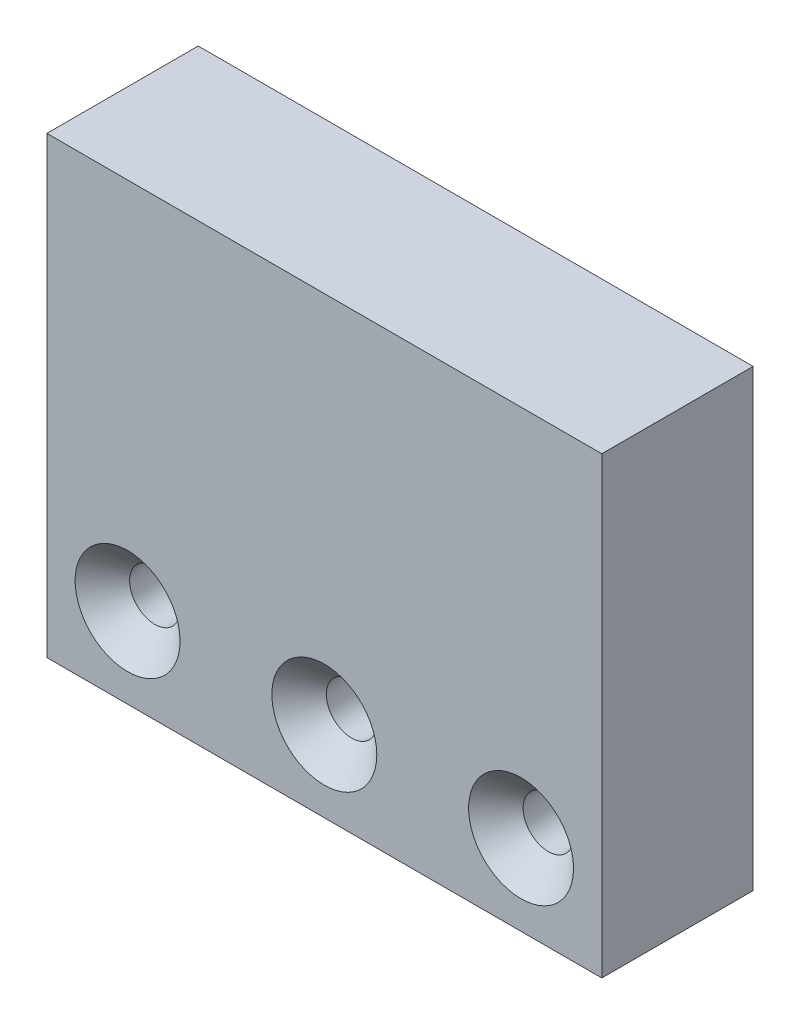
from build123d import *

# Parameters (mm, degrees)
SKETCH1_W                                       = 55
SKETCH1_H                                       = 45
BOSS_EXTRUDE1_DEPTH                             = 15
M5X0_8_TAPPED_HOLE1_D                           = 4.2
M5X0_8_TAPPED_HOLE1_DEPTH                       = 10
M5X0_8_TAPPED_HOLE1_TIP                         = 1.2618073
CSK_FOR_M5_FLAT_HEAD_MACHINE_SCREW1_D           = 5
CSK_FOR_M5_FLAT_HEAD_MACHINE_SCREW1_CSINK_D     = 10.4
CSK_FOR_M5_FLAT_HEAD_MACHINE_SCREW1_CSINK_ANGLE = 90


with BuildPart() as part:
    # Sketch1 → Boss-Extrude1 (new body)
    with BuildSketch(Plane.XY):
        Rectangle(SKETCH1_W, SKETCH1_H)
    extrude(amount=BOSS_EXTRUDE1_DEPTH)

    # M5x0.8 Tapped Hole1
    with Locations(Plane(origin=(15.5, 13.5, 0), x_dir=(-1, 0, 0), z_dir=(0, 0, -1))):
        with Locations((0, 0), (31, 0)):
            Hole(M5X0_8_TAPPED_HOLE1_D / 2, depth=M5X0_8_TAPPED_HOLE1_DEPTH)
            with Locations((0, 0, -(M5X0_8_TAPPED_HOLE1_DEPTH + M5X0_8_TAPPED_HOLE1_TIP / 2))):  # 118° drill point
                Cone(0, M5X0_8_TAPPED_HOLE1_D / 2, M5X0_8_TAPPED_HOLE1_TIP, mode=Mode.SUBTRACT)

    # CSK for M5 Flat Head Machine Screw1 (through all)
    with Locations(Plane(origin=(-19.5, -14.5, 15), x_dir=(1, 0, 0), z_dir=(0, 0, 1))):
        with Locations((0, 0), (19.5, 0), (39, 0)):
            CounterSinkHole(CSK_FOR_M5_FLAT_HEAD_MACHINE_SCREW1_D / 2, CSK_FOR_M5_FLAT_HEAD_MACHINE_SCREW1_CSINK_D / 2, counter_sink_angle=CSK_FOR_M5_FLAT_HEAD_MACHINE_SCREW1_CSINK_ANGLE)


solid = part.part
